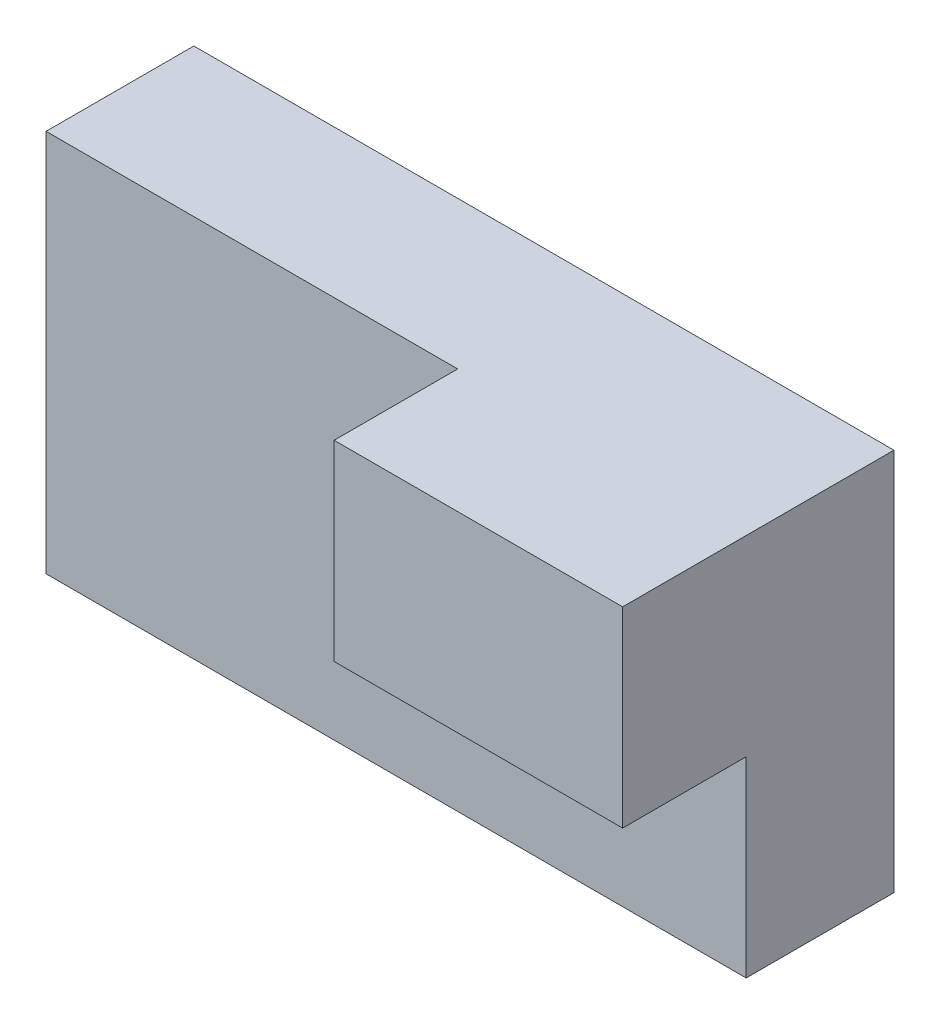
ISO-10303-21;
HEADER;
FILE_DESCRIPTION(('STEP AP214'),'2;1');
FILE_NAME('part.step','',(''),(''),'','','');
FILE_SCHEMA(('AUTOMOTIVE_DESIGN { 1 0 10303 214 1 1 1 1 }'));
ENDSEC;
DATA;
#1=APPLICATION_CONTEXT('core data for automotive mechanical design processes');
#2=APPLICATION_PROTOCOL_DEFINITION('international standard','automotive_design',2000,#1);
#3=PRODUCT_CONTEXT('',#1,'mechanical');
#4=PRODUCT('Part','Part','',(#3));
#5=PRODUCT_RELATED_PRODUCT_CATEGORY('part','',(#4));
#6=PRODUCT_DEFINITION_FORMATION('','',#4);
#7=PRODUCT_DEFINITION_CONTEXT('part definition',#1,'design');
#8=PRODUCT_DEFINITION('design','',#6,#7);
#9=PRODUCT_DEFINITION_SHAPE('','',#8);
#10=(LENGTH_UNIT() NAMED_UNIT(*) SI_UNIT(.MILLI.,.METRE.));
#11=(NAMED_UNIT(*) PLANE_ANGLE_UNIT() SI_UNIT($,.RADIAN.));
#12=(NAMED_UNIT(*) SI_UNIT($,.STERADIAN.) SOLID_ANGLE_UNIT());
#13=UNCERTAINTY_MEASURE_WITH_UNIT(LENGTH_MEASURE(1.E-05),#10,'distance_accuracy_value','');
#14=(GEOMETRIC_REPRESENTATION_CONTEXT(3) GLOBAL_UNCERTAINTY_ASSIGNED_CONTEXT((#13)) GLOBAL_UNIT_ASSIGNED_CONTEXT((#10,
#11,#12)) REPRESENTATION_CONTEXT('',''));
#15=CARTESIAN_POINT('',(0.,0.,0.));
#16=DIRECTION('',(0.,0.,1.));
#17=DIRECTION('',(1.,0.,0.));
#18=AXIS2_PLACEMENT_3D('',#15,#16,#17);
#19=CARTESIAN_POINT('',(-85.0123653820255,46.533357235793,35.8867617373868));
#20=DIRECTION('',(1.,0.,0.));
#21=DIRECTION('',(0.,1.,0.));
#22=AXIS2_PLACEMENT_3D('',#19,#20,#21);
#23=PLANE('',#22);
#24=DIRECTION('',(0.,-1.,0.));
#25=VECTOR('',#24,1.);
#26=CARTESIAN_POINT('',(-85.0123653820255,46.533357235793,0.));
#27=LINE('',#26,#25);
#28=CARTESIAN_POINT('',(-85.0123653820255,46.533357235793,0.));
#29=VERTEX_POINT('',#28);
#30=CARTESIAN_POINT('',(-85.0123653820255,-46.5333572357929,0.));
#31=VERTEX_POINT('',#30);
#32=EDGE_CURVE('E135',#29,#31,#27,.T.);
#33=ORIENTED_EDGE('',*,*,#32,.T.);
#34=DIRECTION('',(0.,0.,-1.));
#35=VECTOR('',#34,1.);
#36=CARTESIAN_POINT('',(-85.0123653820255,-46.5333572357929,35.8867617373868));
#37=LINE('',#36,#35);
#38=CARTESIAN_POINT('',(-85.0123653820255,-46.5333572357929,35.8867617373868));
#39=VERTEX_POINT('',#38);
#40=EDGE_CURVE('E11',#39,#31,#37,.T.);
#41=ORIENTED_EDGE('',*,*,#40,.F.);
#42=DIRECTION('',(0.,-1.,0.));
#43=VECTOR('',#42,1.);
#44=CARTESIAN_POINT('',(-85.0123653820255,46.533357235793,35.8867617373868));
#45=LINE('',#44,#43);
#46=CARTESIAN_POINT('',(-85.0123653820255,46.533357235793,35.8867617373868));
#47=VERTEX_POINT('',#46);
#48=EDGE_CURVE('E160',#47,#39,#45,.T.);
#49=ORIENTED_EDGE('',*,*,#48,.F.);
#50=DIRECTION('',(0.,0.,-1.));
#51=VECTOR('',#50,1.);
#52=CARTESIAN_POINT('',(-85.0123653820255,46.533357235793,35.8867617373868));
#53=LINE('',#52,#51);
#54=EDGE_CURVE('E103',#47,#29,#53,.T.);
#55=ORIENTED_EDGE('',*,*,#54,.T.);
#56=EDGE_LOOP('',(#33,#41,#49,#55));
#57=FACE_BOUND('',#56,.T.);
#58=ADVANCED_FACE('F33',(#57),#23,.F.);
#59=CARTESIAN_POINT('',(-85.0123653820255,-46.5333572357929,35.8867617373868));
#60=DIRECTION('',(0.,1.,0.));
#61=DIRECTION('',(0.,0.,1.));
#62=AXIS2_PLACEMENT_3D('',#59,#60,#61);
#63=PLANE('',#62);
#64=DIRECTION('',(1.,0.,0.));
#65=VECTOR('',#64,1.);
#66=CARTESIAN_POINT('',(-85.0123653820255,-46.5333572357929,0.));
#67=LINE('',#66,#65);
#68=CARTESIAN_POINT('',(85.0123653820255,-46.5333572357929,0.));
#69=VERTEX_POINT('',#68);
#70=EDGE_CURVE('E138',#31,#69,#67,.T.);
#71=ORIENTED_EDGE('',*,*,#70,.T.);
#72=DIRECTION('',(0.,0.,-1.));
#73=VECTOR('',#72,1.);
#74=CARTESIAN_POINT('',(85.0123653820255,-46.5333572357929,35.8867617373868));
#75=LINE('',#74,#73);
#76=CARTESIAN_POINT('',(85.0123653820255,-46.5333572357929,35.8867617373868));
#77=VERTEX_POINT('',#76);
#78=EDGE_CURVE('E41',#77,#69,#75,.T.);
#79=ORIENTED_EDGE('',*,*,#78,.F.);
#80=DIRECTION('',(1.,0.,0.));
#81=VECTOR('',#80,1.);
#82=CARTESIAN_POINT('',(-85.0123653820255,-46.5333572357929,35.8867617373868));
#83=LINE('',#82,#81);
#84=EDGE_CURVE('E165',#39,#77,#83,.T.);
#85=ORIENTED_EDGE('',*,*,#84,.F.);
#86=ORIENTED_EDGE('',*,*,#40,.T.);
#87=EDGE_LOOP('',(#71,#79,#85,#86));
#88=FACE_BOUND('',#87,.T.);
#89=ADVANCED_FACE('F169',(#88),#63,.F.);
#90=CARTESIAN_POINT('',(85.0123653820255,46.533357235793,35.8867617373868));
#91=DIRECTION('',(-1.,0.,0.));
#92=DIRECTION('',(0.,0.,1.));
#93=AXIS2_PLACEMENT_3D('',#90,#91,#92);
#94=PLANE('',#93);
#95=DIRECTION('',(0.,1.,0.));
#96=VECTOR('',#95,1.);
#97=CARTESIAN_POINT('',(85.0123653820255,46.533357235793,0.));
#98=LINE('',#97,#96);
#99=CARTESIAN_POINT('',(85.0123653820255,46.533357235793,0.));
#100=VERTEX_POINT('',#99);
#101=EDGE_CURVE('E100',#69,#100,#98,.T.);
#102=ORIENTED_EDGE('',*,*,#101,.T.);
#103=DIRECTION('',(0.,0.,-1.));
#104=VECTOR('',#103,1.);
#105=CARTESIAN_POINT('',(85.0123653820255,46.533357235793,35.8867617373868));
#106=LINE('',#105,#104);
#107=CARTESIAN_POINT('',(85.0123653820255,46.533357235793,65.8867617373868));
#108=VERTEX_POINT('',#107);
#109=EDGE_CURVE('E92',#108,#100,#106,.T.);
#110=ORIENTED_EDGE('',*,*,#109,.F.);
#111=DIRECTION('',(0.,1.,0.));
#112=VECTOR('',#111,1.);
#113=CARTESIAN_POINT('',(85.0123653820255,46.533357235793,65.8867617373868));
#114=LINE('',#113,#112);
#115=CARTESIAN_POINT('',(85.0123653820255,0.,65.8867617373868));
#116=VERTEX_POINT('',#115);
#117=EDGE_CURVE('E97',#116,#108,#114,.T.);
#118=ORIENTED_EDGE('',*,*,#117,.F.);
#119=DIRECTION('',(0.,0.,-1.));
#120=VECTOR('',#119,1.);
#121=CARTESIAN_POINT('',(85.0123653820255,0.,65.8867617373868));
#122=LINE('',#121,#120);
#123=CARTESIAN_POINT('',(85.0123653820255,0.,35.8867617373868));
#124=VERTEX_POINT('',#123);
#125=EDGE_CURVE('E124',#116,#124,#122,.T.);
#126=ORIENTED_EDGE('',*,*,#125,.T.);
#127=DIRECTION('',(0.,1.,0.));
#128=VECTOR('',#127,1.);
#129=CARTESIAN_POINT('',(85.0123653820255,46.533357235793,35.8867617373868));
#130=LINE('',#129,#128);
#131=EDGE_CURVE('E55',#77,#124,#130,.T.);
#132=ORIENTED_EDGE('',*,*,#131,.F.);
#133=ORIENTED_EDGE('',*,*,#78,.T.);
#134=EDGE_LOOP('',(#102,#110,#118,#126,#132,#133));
#135=FACE_BOUND('',#134,.T.);
#136=ADVANCED_FACE('F94',(#135),#94,.F.);
#137=CARTESIAN_POINT('',(-85.0123653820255,46.533357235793,35.8867617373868));
#138=DIRECTION('',(0.,-1.,0.));
#139=DIRECTION('',(0.,0.,-1.));
#140=AXIS2_PLACEMENT_3D('',#137,#138,#139);
#141=PLANE('',#140);
#142=DIRECTION('',(-1.,0.,0.));
#143=VECTOR('',#142,1.);
#144=CARTESIAN_POINT('',(-85.0123653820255,46.533357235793,0.));
#145=LINE('',#144,#143);
#146=EDGE_CURVE('E158',#100,#29,#145,.T.);
#147=ORIENTED_EDGE('',*,*,#146,.T.);
#148=ORIENTED_EDGE('',*,*,#54,.F.);
#149=DIRECTION('',(-1.,0.,0.));
#150=VECTOR('',#149,1.);
#151=CARTESIAN_POINT('',(-85.0123653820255,46.533357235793,35.8867617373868));
#152=LINE('',#151,#150);
#153=CARTESIAN_POINT('',(14.9504504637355,46.533357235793,35.8867617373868));
#154=VERTEX_POINT('',#153);
#155=EDGE_CURVE('E143',#154,#47,#152,.T.);
#156=ORIENTED_EDGE('',*,*,#155,.F.);
#157=DIRECTION('',(0.,0.,-1.));
#158=VECTOR('',#157,1.);
#159=CARTESIAN_POINT('',(14.9504504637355,46.533357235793,65.8867617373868));
#160=LINE('',#159,#158);
#161=CARTESIAN_POINT('',(14.9504504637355,46.533357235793,65.8867617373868));
#162=VERTEX_POINT('',#161);
#163=EDGE_CURVE('E109',#162,#154,#160,.T.);
#164=ORIENTED_EDGE('',*,*,#163,.F.);
#165=DIRECTION('',(-1.,0.,0.));
#166=VECTOR('',#165,1.);
#167=CARTESIAN_POINT('',(85.0123653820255,46.533357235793,65.8867617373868));
#168=LINE('',#167,#166);
#169=EDGE_CURVE('E106',#108,#162,#168,.T.);
#170=ORIENTED_EDGE('',*,*,#169,.F.);
#171=ORIENTED_EDGE('',*,*,#109,.T.);
#172=EDGE_LOOP('',(#147,#148,#156,#164,#170,#171));
#173=FACE_BOUND('',#172,.T.);
#174=ADVANCED_FACE('F107',(#173),#141,.F.);
#175=CARTESIAN_POINT('',(-85.0123653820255,-46.5333572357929,35.8867617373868));
#176=DIRECTION('',(0.,0.,1.));
#177=DIRECTION('',(1.,0.,0.));
#178=AXIS2_PLACEMENT_3D('',#175,#176,#177);
#179=PLANE('',#178);
#180=DIRECTION('',(1.,0.,0.));
#181=VECTOR('',#180,1.);
#182=CARTESIAN_POINT('',(85.0123653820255,0.,35.8867617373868));
#183=LINE('',#182,#181);
#184=CARTESIAN_POINT('',(14.9504504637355,0.,35.8867617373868));
#185=VERTEX_POINT('',#184);
#186=EDGE_CURVE('E118',#185,#124,#183,.T.);
#187=ORIENTED_EDGE('',*,*,#186,.F.);
#188=DIRECTION('',(0.,-1.,0.));
#189=VECTOR('',#188,1.);
#190=CARTESIAN_POINT('',(14.9504504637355,46.533357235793,35.8867617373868));
#191=LINE('',#190,#189);
#192=EDGE_CURVE('E49',#154,#185,#191,.T.);
#193=ORIENTED_EDGE('',*,*,#192,.F.);
#194=ORIENTED_EDGE('',*,*,#155,.T.);
#195=ORIENTED_EDGE('',*,*,#48,.T.);
#196=ORIENTED_EDGE('',*,*,#84,.T.);
#197=ORIENTED_EDGE('',*,*,#131,.T.);
#198=EDGE_LOOP('',(#187,#193,#194,#195,#196,#197));
#199=FACE_BOUND('',#198,.T.);
#200=ADVANCED_FACE('F166',(#199),#179,.T.);
#201=CARTESIAN_POINT('',(-85.0123653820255,-46.5333572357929,0.));
#202=DIRECTION('',(0.,0.,1.));
#203=DIRECTION('',(1.,0.,0.));
#204=AXIS2_PLACEMENT_3D('',#201,#202,#203);
#205=PLANE('',#204);
#206=ORIENTED_EDGE('',*,*,#32,.F.);
#207=ORIENTED_EDGE('',*,*,#146,.F.);
#208=ORIENTED_EDGE('',*,*,#101,.F.);
#209=ORIENTED_EDGE('',*,*,#70,.F.);
#210=EDGE_LOOP('',(#206,#207,#208,#209));
#211=FACE_BOUND('',#210,.T.);
#212=ADVANCED_FACE('F157',(#211),#205,.F.);
#213=CARTESIAN_POINT('',(14.9504504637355,46.533357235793,65.8867617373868));
#214=DIRECTION('',(1.,0.,0.));
#215=DIRECTION('',(0.,0.,-1.));
#216=AXIS2_PLACEMENT_3D('',#213,#214,#215);
#217=PLANE('',#216);
#218=ORIENTED_EDGE('',*,*,#192,.T.);
#219=DIRECTION('',(0.,0.,-1.));
#220=VECTOR('',#219,1.);
#221=CARTESIAN_POINT('',(14.9504504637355,0.,65.8867617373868));
#222=LINE('',#221,#220);
#223=CARTESIAN_POINT('',(14.9504504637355,0.,65.8867617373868));
#224=VERTEX_POINT('',#223);
#225=EDGE_CURVE('E127',#224,#185,#222,.T.);
#226=ORIENTED_EDGE('',*,*,#225,.F.);
#227=DIRECTION('',(0.,-1.,0.));
#228=VECTOR('',#227,1.);
#229=CARTESIAN_POINT('',(14.9504504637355,46.533357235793,65.8867617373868));
#230=LINE('',#229,#228);
#231=EDGE_CURVE('E112',#162,#224,#230,.T.);
#232=ORIENTED_EDGE('',*,*,#231,.F.);
#233=ORIENTED_EDGE('',*,*,#163,.T.);
#234=EDGE_LOOP('',(#218,#226,#232,#233));
#235=FACE_BOUND('',#234,.T.);
#236=ADVANCED_FACE('F187',(#235),#217,.F.);
#237=CARTESIAN_POINT('',(85.0123653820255,0.,65.8867617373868));
#238=DIRECTION('',(0.,1.,0.));
#239=DIRECTION('',(0.,0.,1.));
#240=AXIS2_PLACEMENT_3D('',#237,#238,#239);
#241=PLANE('',#240);
#242=ORIENTED_EDGE('',*,*,#186,.T.);
#243=ORIENTED_EDGE('',*,*,#125,.F.);
#244=DIRECTION('',(1.,0.,0.));
#245=VECTOR('',#244,1.);
#246=CARTESIAN_POINT('',(85.0123653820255,0.,65.8867617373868));
#247=LINE('',#246,#245);
#248=EDGE_CURVE('E116',#224,#116,#247,.T.);
#249=ORIENTED_EDGE('',*,*,#248,.F.);
#250=ORIENTED_EDGE('',*,*,#225,.T.);
#251=EDGE_LOOP('',(#242,#243,#249,#250));
#252=FACE_BOUND('',#251,.T.);
#253=ADVANCED_FACE('F190',(#252),#241,.F.);
#254=CARTESIAN_POINT('',(0.,0.,65.8867617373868));
#255=DIRECTION('',(0.,0.,-1.));
#256=DIRECTION('',(-1.,0.,0.));
#257=AXIS2_PLACEMENT_3D('',#254,#255,#256);
#258=PLANE('',#257);
#259=ORIENTED_EDGE('',*,*,#117,.T.);
#260=ORIENTED_EDGE('',*,*,#169,.T.);
#261=ORIENTED_EDGE('',*,*,#231,.T.);
#262=ORIENTED_EDGE('',*,*,#248,.T.);
#263=EDGE_LOOP('',(#259,#260,#261,#262));
#264=FACE_BOUND('',#263,.T.);
#265=ADVANCED_FACE('F114',(#264),#258,.F.);
#266=CLOSED_SHELL('',(#58,#89,#136,#174,#200,#212,#236,#253,#265));
#267=MANIFOLD_SOLID_BREP('B2',#266);
#268=ADVANCED_BREP_SHAPE_REPRESENTATION('',(#18,#267),#14);
#269=SHAPE_DEFINITION_REPRESENTATION(#9,#268);
ENDSEC;
END-ISO-10303-21;
